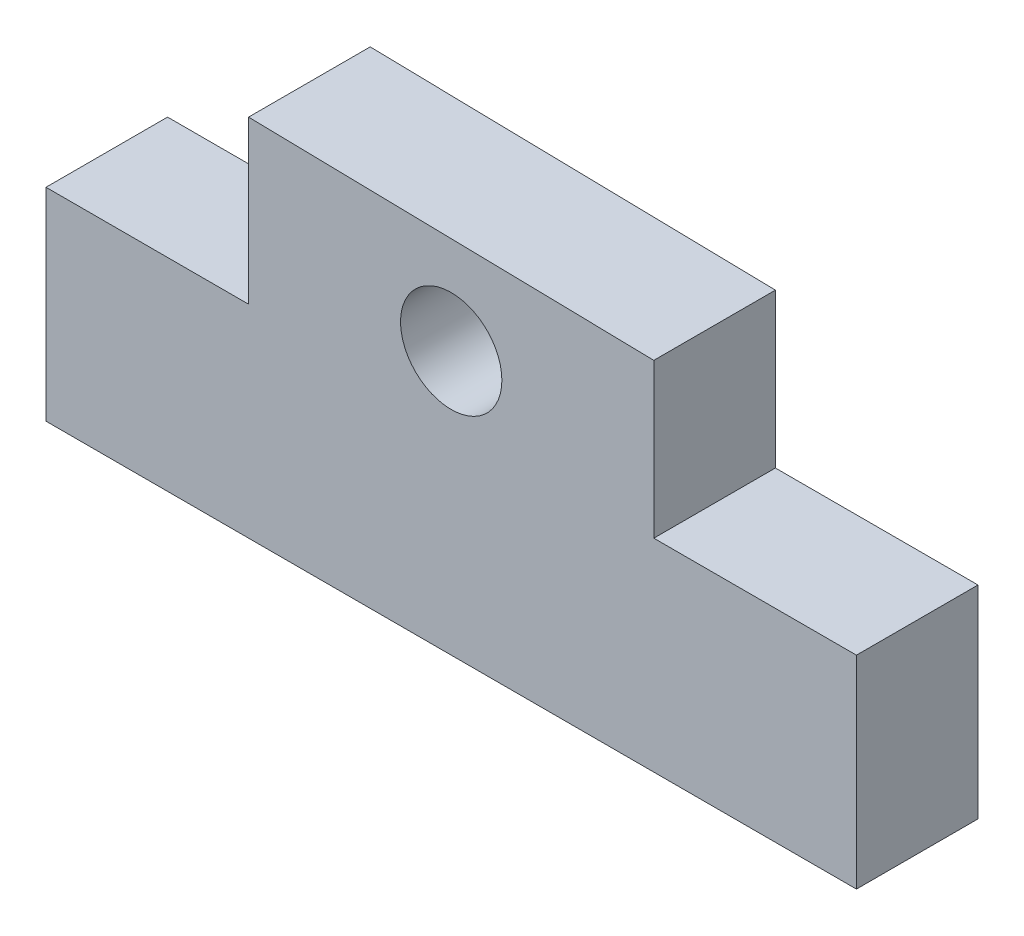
from build123d import *

# Parameters (mm, degrees)
SKETCH1_R           = 1.25
BOSS_EXTRUDE1_DEPTH = 3


with BuildPart() as part:
    # Sketch1 → Boss-Extrude1 (new body)
    with BuildSketch(Plane.XY):
        Polygon((60.387348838, 257.707308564), (65.387348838, 257.707308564), (65.387348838, 252.707308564), (45.387348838, 252.707308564), (45.387348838, 257.707308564), (50.387348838, 257.707308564), (50.387348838, 261.707308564), (60.387348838, 261.508801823), align=None)
        with Locations((55.387348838, 259.207308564)):
            Circle(SKETCH1_R, mode=Mode.SUBTRACT)
    extrude(amount=BOSS_EXTRUDE1_DEPTH)


solid = part.part
